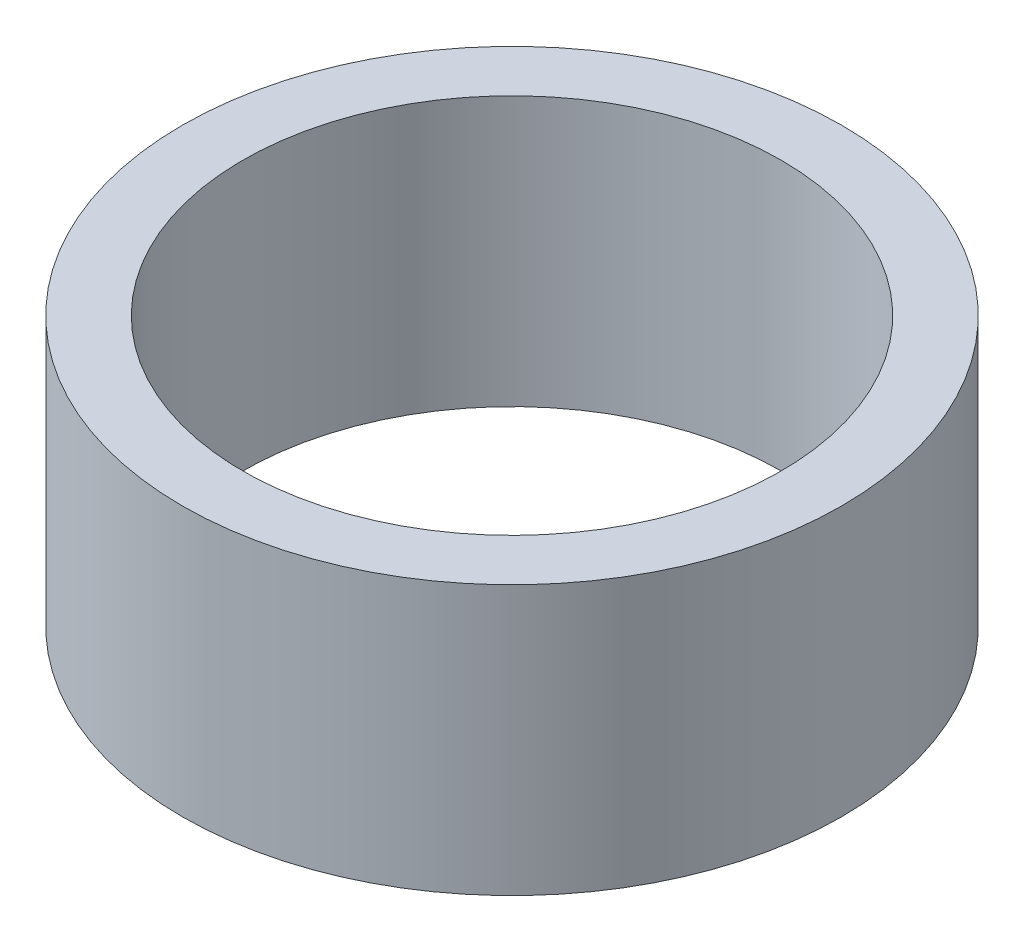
from build123d import *

# Parameters (mm, degrees)
SKETCH3_R           = 34.6075
SKETCH3_R_2         = 28.2575
BOSS_EXTRUDE1_DEPTH = 28.2575


with BuildPart() as part:
    # Sketch3 → Boss-Extrude1 (new body)
    with BuildSketch(Plane(origin=(0, 0, 0), x_dir=(1, 0, 0), z_dir=(0, 1, 0))):
        with Locations(Location((0, 0, 0), (0, 0, 90))):
            Circle(SKETCH3_R)
        with Locations(Location((0, 0, 0), (0, 0, 90))):
            Circle(SKETCH3_R_2, mode=Mode.SUBTRACT)
    extrude(amount=BOSS_EXTRUDE1_DEPTH)


solid = part.part
